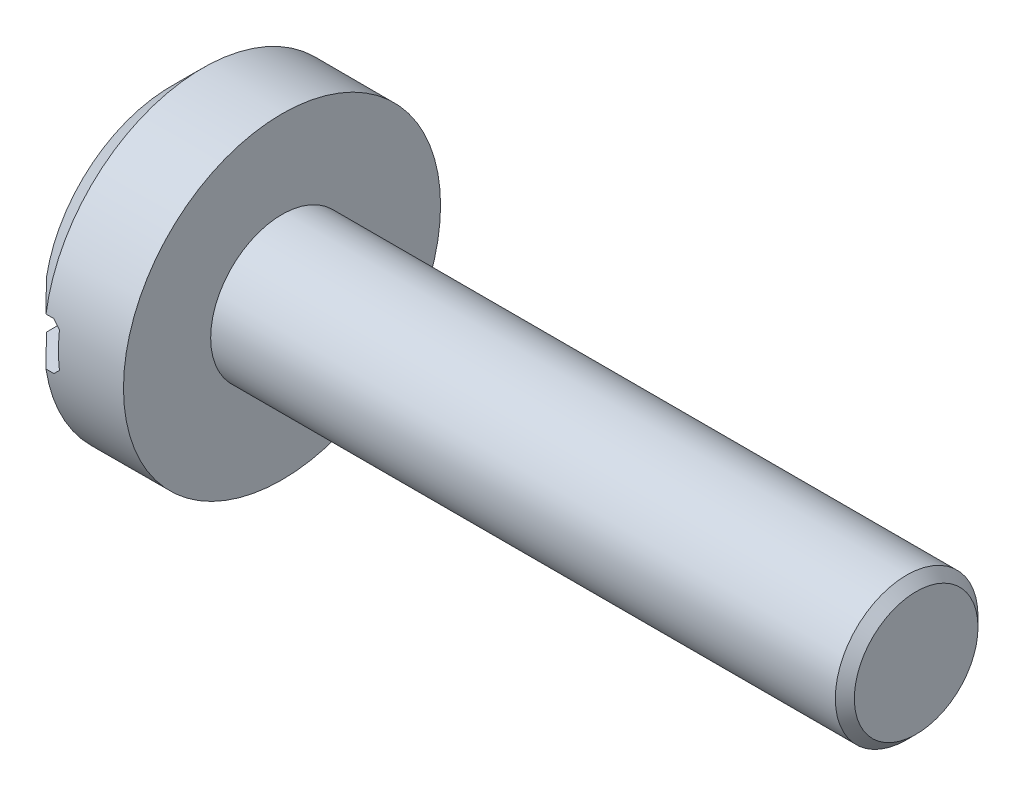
ISO-10303-21;
HEADER;
FILE_DESCRIPTION(('STEP AP214'),'2;1');
FILE_NAME('part.step','',(''),(''),'','','');
FILE_SCHEMA(('AUTOMOTIVE_DESIGN { 1 0 10303 214 1 1 1 1 }'));
ENDSEC;
DATA;
#1=APPLICATION_CONTEXT('core data for automotive mechanical design processes');
#2=APPLICATION_PROTOCOL_DEFINITION('international standard','automotive_design',2000,#1);
#3=PRODUCT_CONTEXT('',#1,'mechanical');
#4=PRODUCT('Part','Part','',(#3));
#5=PRODUCT_RELATED_PRODUCT_CATEGORY('part','',(#4));
#6=PRODUCT_DEFINITION_FORMATION('','',#4);
#7=PRODUCT_DEFINITION_CONTEXT('part definition',#1,'design');
#8=PRODUCT_DEFINITION('design','',#6,#7);
#9=PRODUCT_DEFINITION_SHAPE('','',#8);
#10=(LENGTH_UNIT() NAMED_UNIT(*) SI_UNIT(.MILLI.,.METRE.));
#11=(NAMED_UNIT(*) PLANE_ANGLE_UNIT() SI_UNIT($,.RADIAN.));
#12=(NAMED_UNIT(*) SI_UNIT($,.STERADIAN.) SOLID_ANGLE_UNIT());
#13=UNCERTAINTY_MEASURE_WITH_UNIT(LENGTH_MEASURE(1.E-05),#10,'distance_accuracy_value','');
#14=(GEOMETRIC_REPRESENTATION_CONTEXT(3) GLOBAL_UNCERTAINTY_ASSIGNED_CONTEXT((#13)) GLOBAL_UNIT_ASSIGNED_CONTEXT((#10,
#11,#12)) REPRESENTATION_CONTEXT('',''));
#15=CARTESIAN_POINT('',(0.,0.,0.));
#16=DIRECTION('',(0.,0.,1.));
#17=DIRECTION('',(1.,0.,0.));
#18=AXIS2_PLACEMENT_3D('',#15,#16,#17);
#19=CARTESIAN_POINT('',(3.5,5.,0.));
#20=DIRECTION('',(-1.,0.,0.));
#21=DIRECTION('',(0.,0.,1.));
#22=AXIS2_PLACEMENT_3D('',#19,#20,#21);
#23=PLANE('',#22);
#24=CARTESIAN_POINT('',(3.5,0.,0.));
#25=DIRECTION('',(-1.,0.,0.));
#26=DIRECTION('',(0.,0.,1.));
#27=AXIS2_PLACEMENT_3D('',#24,#25,#26);
#28=CIRCLE('',#27,5.);
#29=CARTESIAN_POINT('',(3.5,0.,5.));
#30=VERTEX_POINT('',#29);
#31=EDGE_CURVE('E99',#30,#30,#28,.T.);
#32=ORIENTED_EDGE('',*,*,#31,.F.);
#33=EDGE_LOOP('',(#32));
#34=FACE_BOUND('',#33,.T.);
#35=CARTESIAN_POINT('',(3.5,0.,0.));
#36=DIRECTION('',(-1.,0.,0.));
#37=DIRECTION('',(0.,0.,1.));
#38=AXIS2_PLACEMENT_3D('',#35,#36,#37);
#39=CIRCLE('',#38,2.25);
#40=CARTESIAN_POINT('',(3.5,0.,2.25));
#41=VERTEX_POINT('',#40);
#42=EDGE_CURVE('E136',#41,#41,#39,.F.);
#43=ORIENTED_EDGE('',*,*,#42,.F.);
#44=EDGE_LOOP('',(#43));
#45=FACE_BOUND('',#44,.T.);
#46=ADVANCED_FACE('F26',(#34,#45),#23,.F.);
#47=CARTESIAN_POINT('',(1.,0.,0.));
#48=DIRECTION('',(1.,0.,0.));
#49=DIRECTION('',(0.,0.,-1.));
#50=AXIS2_PLACEMENT_3D('',#47,#48,#49);
#51=CONICAL_SURFACE('',#50,5.,0.785398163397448);
#52=CARTESIAN_POINT('',(1.,0.,0.));
#53=DIRECTION('',(-1.,0.,0.));
#54=DIRECTION('',(0.,0.,1.));
#55=AXIS2_PLACEMENT_3D('',#52,#53,#54);
#56=CIRCLE('',#55,5.);
#57=CARTESIAN_POINT('',(1.,0.75,4.9434299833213));
#58=VERTEX_POINT('',#57);
#59=CARTESIAN_POINT('',(1.,0.75,-4.9434299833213));
#60=VERTEX_POINT('',#59);
#61=EDGE_CURVE('E121',#58,#60,#56,.T.);
#62=ORIENTED_EDGE('',*,*,#61,.T.);
#63=CARTESIAN_POINT('',(7.03012537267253,0.75,-11.0045974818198));
#64=CARTESIAN_POINT('',(6.65072201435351,0.75,-10.6243069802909));
#65=CARTESIAN_POINT('',(6.27135757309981,0.75,-10.2439776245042));
#66=CARTESIAN_POINT('',(5.51274800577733,0.75,-9.48318217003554));
#67=CARTESIAN_POINT('',(5.13350288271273,0.75,-9.10271606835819));
#68=CARTESIAN_POINT('',(4.37498838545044,0.75,-8.34140232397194));
#69=CARTESIAN_POINT('',(3.99571910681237,0.75,-7.96055458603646));
#70=CARTESIAN_POINT('',(3.23746281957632,0.75,-7.19859550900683));
#71=CARTESIAN_POINT('',(2.85847580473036,0.75,-6.81748417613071));
#72=CARTESIAN_POINT('',(2.09938544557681,0.75,-6.05326438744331));
#73=CARTESIAN_POINT('',(1.71928389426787,0.75,-5.67015414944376));
#74=CARTESIAN_POINT('',(1.14971850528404,0.75,-5.09488067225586));
#75=CARTESIAN_POINT('',(0.959954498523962,0.75,-4.90301469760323));
#76=CARTESIAN_POINT('',(0.58071485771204,0.75,-4.51900057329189));
#77=CARTESIAN_POINT('',(0.391239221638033,0.75,-4.32685242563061));
#78=CARTESIAN_POINT('',(0.0127694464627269,0.75,-3.94220808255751));
#79=CARTESIAN_POINT('',(-0.176224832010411,0.75,-3.74971202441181));
#80=CARTESIAN_POINT('',(-0.553564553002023,0.75,-3.36407475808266));
#81=CARTESIAN_POINT('',(-0.741909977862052,0.75,-3.17093353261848));
#82=CARTESIAN_POINT('',(-1.11750282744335,0.75,-2.78362867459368));
#83=CARTESIAN_POINT('',(-1.3047503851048,0.75,-2.58946517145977));
#84=CARTESIAN_POINT('',(-1.5840700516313,0.75,-2.29674613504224));
#85=CARTESIAN_POINT('',(-1.67691597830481,0.75,-2.19892965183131));
#86=CARTESIAN_POINT('',(-1.86184376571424,0.75,-2.00257777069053));
#87=CARTESIAN_POINT('',(-1.95392563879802,0.75,-1.90404238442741));
#88=CARTESIAN_POINT('',(-2.09519988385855,0.75,-1.7510526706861));
#89=CARTESIAN_POINT('',(-2.14480705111,0.75,-1.69698162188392));
#90=CARTESIAN_POINT('',(-2.24356406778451,0.75,-1.58841990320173));
#91=CARTESIAN_POINT('',(-2.29271390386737,0.75,-1.53392922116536));
#92=CARTESIAN_POINT('',(-2.39043946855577,0.75,-1.42435939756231));
#93=CARTESIAN_POINT('',(-2.43901472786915,0.75,-1.36927983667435));
#94=CARTESIAN_POINT('',(-2.53532026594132,0.75,-1.25838999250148));
#95=CARTESIAN_POINT('',(-2.58305059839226,0.75,-1.20257975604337));
#96=CARTESIAN_POINT('',(-2.66798512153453,0.75,-1.10107872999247));
#97=CARTESIAN_POINT('',(-2.70540474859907,0.75,-1.05556872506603));
#98=CARTESIAN_POINT('',(-2.77916585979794,0.75,-0.963684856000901));
#99=CARTESIAN_POINT('',(-2.81550743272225,0.75,-0.917311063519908));
#100=CARTESIAN_POINT('',(-2.88665253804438,0.75,-0.823398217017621));
#101=CARTESIAN_POINT('',(-2.92145624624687,0.75,-0.775859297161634));
#102=CARTESIAN_POINT('',(-2.98876467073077,0.75,-0.679192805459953));
#103=CARTESIAN_POINT('',(-3.02127049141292,0.75,-0.630066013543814));
#104=CARTESIAN_POINT('',(-3.08296458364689,0.75,-0.529211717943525));
#105=CARTESIAN_POINT('',(-3.11212542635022,0.75,-0.477467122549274));
#106=CARTESIAN_POINT('',(-3.16453270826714,0.75,-0.371006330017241));
#107=CARTESIAN_POINT('',(-3.18778740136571,0.75,-0.316294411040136));
#108=CARTESIAN_POINT('',(-3.22049853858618,0.75,-0.216346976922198));
#109=CARTESIAN_POINT('',(-3.23188688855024,0.75,-0.171770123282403));
#110=CARTESIAN_POINT('',(-3.2469012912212,0.75,-0.0813810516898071));
#111=CARTESIAN_POINT('',(-3.2505503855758,0.75,-0.0355729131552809));
#112=CARTESIAN_POINT('',(-3.24931001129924,0.75,0.0560387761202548));
#113=CARTESIAN_POINT('',(-3.24439828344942,0.75,0.101842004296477));
#114=CARTESIAN_POINT('',(-3.22708453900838,0.75,0.192036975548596));
#115=CARTESIAN_POINT('',(-3.21466383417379,0.75,0.236424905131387));
#116=CARTESIAN_POINT('',(-3.18235241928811,0.75,0.328895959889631));
#117=CARTESIAN_POINT('',(-3.161695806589,0.75,0.376700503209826));
#118=CARTESIAN_POINT('',(-3.11579054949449,0.75,0.470089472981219));
#119=CARTESIAN_POINT('',(-3.09053255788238,0.75,0.515669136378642));
#120=CARTESIAN_POINT('',(-3.03681278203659,0.75,0.605417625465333));
#121=CARTESIAN_POINT('',(-3.00832459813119,0.75,0.649570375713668));
#122=CARTESIAN_POINT('',(-2.94936099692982,0.75,0.736448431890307));
#123=CARTESIAN_POINT('',(-2.91888753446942,0.75,0.779175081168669));
#124=CARTESIAN_POINT('',(-2.85342343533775,0.75,0.867824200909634));
#125=CARTESIAN_POINT('',(-2.8182861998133,0.75,0.913637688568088));
#126=CARTESIAN_POINT('',(-2.74683416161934,0.75,1.00434011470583));
#127=CARTESIAN_POINT('',(-2.71051921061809,0.75,1.04922893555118));
#128=CARTESIAN_POINT('',(-2.60029175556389,0.75,1.18290062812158));
#129=CARTESIAN_POINT('',(-2.52512759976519,0.75,1.27064819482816));
#130=CARTESIAN_POINT('',(-2.37280922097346,0.75,1.44464108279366));
#131=CARTESIAN_POINT('',(-2.29565184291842,0.75,1.53088360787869));
#132=CARTESIAN_POINT('',(-2.14017796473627,0.75,1.70227416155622));
#133=CARTESIAN_POINT('',(-2.0618617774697,0.75,1.78742247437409));
#134=CARTESIAN_POINT('',(-1.90480962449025,0.75,1.95660472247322));
#135=CARTESIAN_POINT('',(-1.82607721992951,0.75,2.0406419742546));
#136=CARTESIAN_POINT('',(-1.66806546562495,0.75,2.20821082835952));
#137=CARTESIAN_POINT('',(-1.58878607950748,0.75,2.29174239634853));
#138=CARTESIAN_POINT('',(-1.42991409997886,0.75,2.45834685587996));
#139=CARTESIAN_POINT('',(-1.35032190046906,0.75,2.54142012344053));
#140=CARTESIAN_POINT('',(-1.19084446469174,0.75,2.70728111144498));
#141=CARTESIAN_POINT('',(-1.11095923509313,0.75,2.79006883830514));
#142=CARTESIAN_POINT('',(-0.86524852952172,0.75,3.04402003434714));
#143=CARTESIAN_POINT('',(-0.69905576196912,0.75,3.21482801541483));
#144=CARTESIAN_POINT('',(-0.366080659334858,0.75,3.55586861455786));
#145=CARTESIAN_POINT('',(-0.199298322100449,0.75,3.72610123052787));
#146=CARTESIAN_POINT('',(0.301629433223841,0.75,4.23624010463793));
#147=CARTESIAN_POINT('',(0.636349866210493,0.75,4.57558150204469));
#148=CARTESIAN_POINT('',(1.3067083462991,0.75,5.25368126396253));
#149=CARTESIAN_POINT('',(1.64234676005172,0.75,5.59243926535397));
#150=CARTESIAN_POINT('',(2.31406719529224,0.75,6.26950975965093));
#151=CARTESIAN_POINT('',(2.65014921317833,0.75,6.60782225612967));
#152=CARTESIAN_POINT('',(3.32307813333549,0.75,7.28466069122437));
#153=CARTESIAN_POINT('',(3.6599254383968,0.75,7.6231862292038));
#154=CARTESIAN_POINT('',(4.33380810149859,0.75,8.3000519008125));
#155=CARTESIAN_POINT('',(4.67084346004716,0.75,8.63839203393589));
#156=CARTESIAN_POINT('',(5.34486656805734,0.75,9.31476389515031));
#157=CARTESIAN_POINT('',(5.68185424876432,0.75,9.65279569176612));
#158=CARTESIAN_POINT('',(6.35592573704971,0.75,10.3287614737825));
#159=CARTESIAN_POINT('',(6.69300954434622,0.75,10.6666954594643));
#160=CARTESIAN_POINT('',(7.03012537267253,0.75,11.0045974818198));
#161=B_SPLINE_CURVE_WITH_KNOTS('',3,(#63,#64,#65,#66,#67,#68,#69,#70,#71,#72,#73,#74,#75,#76,
#77,#78,#79,#80,#81,#82,#83,#84,#85,#86,#87,#88,#89,#90,#91,#92,#93,#94,#95,#96,#97,#98,#99,
#100,#101,#102,#103,#104,#105,#106,#107,#108,#109,#110,#111,#112,#113,#114,#115,#116,#117,#118,
#119,#120,#121,#122,#123,#124,#125,#126,#127,#128,#129,#130,#131,#132,#133,#134,#135,#136,#137,
#138,#139,#140,#141,#142,#143,#144,#145,#146,#147,#148,#149,#150,#151,#152,#153,#154,#155,#156,
#157,#158,#159,#160),.UNSPECIFIED.,.F.,.F.,(4,2,2,2,2,2,2,2,2,2,2,2,2,2,2,2,2,2,2,2,2,2,2,2,2,2,
2,2,2,2,2,2,2,2,2,2,2,2,2,2,2,2,2,2,2,2,2,2,4),(0.,1.61155516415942,3.22314809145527,
4.83560315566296,6.44802139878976,8.0670498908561,8.87662139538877,9.68618719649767,
10.49548331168,11.3048012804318,12.1140191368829,12.5186103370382,12.9231949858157,
13.1433315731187,13.3634745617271,13.583786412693,13.8040842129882,13.9808284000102,
14.1575579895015,14.3342673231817,14.5108911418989,14.6888729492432,14.8666046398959,
15.0041007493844,15.1411869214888,15.2786300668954,15.4164166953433,15.5722691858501,
15.7284418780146,15.8859980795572,16.0434014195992,16.2165832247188,16.389786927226,
16.7363472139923,17.0834944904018,17.4305496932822,17.7760166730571,18.1215068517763,
18.4666505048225,18.8117863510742,19.5267371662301,20.2416905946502,21.6716220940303,
23.1022479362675,24.5328622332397,25.9655487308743,27.3982391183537,28.830173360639,
30.262103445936),.UNSPECIFIED.);
#162=CARTESIAN_POINT('',(0.,0.75,-3.92905841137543));
#163=VERTEX_POINT('',#162);
#164=EDGE_CURVE('E116',#60,#163,#161,.T.);
#165=ORIENTED_EDGE('',*,*,#164,.T.);
#166=CARTESIAN_POINT('',(0.,0.,0.));
#167=DIRECTION('',(-1.,0.,0.));
#168=DIRECTION('',(0.,0.,1.));
#169=AXIS2_PLACEMENT_3D('',#166,#167,#168);
#170=CIRCLE('',#169,4.);
#171=CARTESIAN_POINT('',(0.,0.75,3.92905841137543));
#172=VERTEX_POINT('',#171);
#173=EDGE_CURVE('E111',#172,#163,#170,.T.);
#174=ORIENTED_EDGE('',*,*,#173,.F.);
#175=EDGE_CURVE('E183',#172,#58,#161,.T.);
#176=ORIENTED_EDGE('',*,*,#175,.T.);
#177=EDGE_LOOP('',(#62,#165,#174,#176));
#178=FACE_BOUND('',#177,.T.);
#179=ADVANCED_FACE('F154',(#178),#51,.T.);
#180=CARTESIAN_POINT('',(0.,0.,0.));
#181=DIRECTION('',(1.,0.,0.));
#182=DIRECTION('',(0.,0.,-1.));
#183=AXIS2_PLACEMENT_3D('',#180,#181,#182);
#184=PLANE('',#183);
#185=ORIENTED_EDGE('',*,*,#173,.T.);
#186=DIRECTION('',(0.,0.,1.));
#187=VECTOR('',#186,1.);
#188=CARTESIAN_POINT('',(0.,0.75,0.));
#189=LINE('',#188,#187);
#190=EDGE_CURVE('E98',#163,#172,#189,.T.);
#191=ORIENTED_EDGE('',*,*,#190,.T.);
#192=EDGE_LOOP('',(#185,#191));
#193=FACE_BOUND('',#192,.T.);
#194=ADVANCED_FACE('F161',(#193),#184,.F.);
#195=CARTESIAN_POINT('',(0.,0.,0.));
#196=DIRECTION('',(-1.,0.,0.));
#197=DIRECTION('',(0.,0.,1.));
#198=AXIS2_PLACEMENT_3D('',#195,#196,#197);
#199=CYLINDRICAL_SURFACE('',#198,5.);
#200=ORIENTED_EDGE('',*,*,#61,.F.);
#201=DIRECTION('',(-1.,0.,0.));
#202=VECTOR('',#201,1.);
#203=CARTESIAN_POINT('',(0.,0.75,4.9434299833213));
#204=LINE('',#203,#202);
#205=CARTESIAN_POINT('',(1.25,0.75,4.9434299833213));
#206=VERTEX_POINT('',#205);
#207=EDGE_CURVE('E189',#58,#206,#204,.F.);
#208=ORIENTED_EDGE('',*,*,#207,.T.);
#209=CARTESIAN_POINT('',(2.,0.,0.));
#210=DIRECTION('',(0.707106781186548,0.707106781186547,0.));
#211=DIRECTION('',(-0.707106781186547,0.707106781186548,0.));
#212=AXIS2_PLACEMENT_3D('',#209,#210,#211);
#213=ELLIPSE('',#212,7.07106781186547,5.);
#214=CARTESIAN_POINT('',(1.45,0.55,4.9696579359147));
#215=VERTEX_POINT('',#214);
#216=EDGE_CURVE('E135',#206,#215,#213,.T.);
#217=ORIENTED_EDGE('',*,*,#216,.T.);
#218=CARTESIAN_POINT('',(1.45,0.,0.));
#219=DIRECTION('',(1.,0.,0.));
#220=DIRECTION('',(0.,1.,0.));
#221=AXIS2_PLACEMENT_3D('',#218,#219,#220);
#222=CIRCLE('',#221,5.);
#223=CARTESIAN_POINT('',(1.45,-0.55,4.9696579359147));
#224=VERTEX_POINT('',#223);
#225=EDGE_CURVE('E48',#215,#224,#222,.T.);
#226=ORIENTED_EDGE('',*,*,#225,.T.);
#227=CARTESIAN_POINT('',(2.,0.,0.));
#228=DIRECTION('',(0.707106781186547,-0.707106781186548,0.));
#229=DIRECTION('',(-0.707106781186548,-0.707106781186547,0.));
#230=AXIS2_PLACEMENT_3D('',#227,#228,#229);
#231=ELLIPSE('',#230,7.07106781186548,5.);
#232=CARTESIAN_POINT('',(1.25,-0.75,4.9434299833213));
#233=VERTEX_POINT('',#232);
#234=EDGE_CURVE('E127',#224,#233,#231,.T.);
#235=ORIENTED_EDGE('',*,*,#234,.T.);
#236=DIRECTION('',(-1.,0.,0.));
#237=VECTOR('',#236,1.);
#238=CARTESIAN_POINT('',(0.,-0.75,4.9434299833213));
#239=LINE('',#238,#237);
#240=CARTESIAN_POINT('',(1.,-0.75,4.9434299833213));
#241=VERTEX_POINT('',#240);
#242=EDGE_CURVE('E107',#233,#241,#239,.T.);
#243=ORIENTED_EDGE('',*,*,#242,.T.);
#244=CARTESIAN_POINT('',(1.,-0.75,-4.9434299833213));
#245=VERTEX_POINT('',#244);
#246=EDGE_CURVE('E106',#245,#241,#56,.T.);
#247=ORIENTED_EDGE('',*,*,#246,.F.);
#248=DIRECTION('',(-1.,0.,0.));
#249=VECTOR('',#248,1.);
#250=CARTESIAN_POINT('',(0.,-0.75,-4.9434299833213));
#251=LINE('',#250,#249);
#252=CARTESIAN_POINT('',(1.25,-0.75,-4.9434299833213));
#253=VERTEX_POINT('',#252);
#254=EDGE_CURVE('E108',#245,#253,#251,.F.);
#255=ORIENTED_EDGE('',*,*,#254,.T.);
#256=CARTESIAN_POINT('',(1.45,-0.55,-4.9696579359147));
#257=VERTEX_POINT('',#256);
#258=EDGE_CURVE('E131',#253,#257,#231,.T.);
#259=ORIENTED_EDGE('',*,*,#258,.T.);
#260=CARTESIAN_POINT('',(1.45,0.55,-4.9696579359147));
#261=VERTEX_POINT('',#260);
#262=EDGE_CURVE('E128',#257,#261,#222,.T.);
#263=ORIENTED_EDGE('',*,*,#262,.T.);
#264=CARTESIAN_POINT('',(1.25,0.75,-4.9434299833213));
#265=VERTEX_POINT('',#264);
#266=EDGE_CURVE('E132',#261,#265,#213,.T.);
#267=ORIENTED_EDGE('',*,*,#266,.T.);
#268=DIRECTION('',(-1.,0.,0.));
#269=VECTOR('',#268,1.);
#270=CARTESIAN_POINT('',(0.,0.75,-4.9434299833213));
#271=LINE('',#270,#269);
#272=EDGE_CURVE('E112',#265,#60,#271,.T.);
#273=ORIENTED_EDGE('',*,*,#272,.T.);
#274=EDGE_LOOP('',(#200,#208,#217,#226,#235,#243,#247,#255,#259,#263,#267,#273));
#275=FACE_BOUND('',#274,.T.);
#276=ORIENTED_EDGE('',*,*,#31,.T.);
#277=EDGE_LOOP('',(#276));
#278=FACE_BOUND('',#277,.T.);
#279=ADVANCED_FACE('F194',(#275,#278),#199,.T.);
#280=ORIENTED_EDGE('',*,*,#246,.T.);
#281=CARTESIAN_POINT('',(7.03012537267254,-0.75,11.0045974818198));
#282=CARTESIAN_POINT('',(6.65072201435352,-0.75,10.6243069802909));
#283=CARTESIAN_POINT('',(6.27135757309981,-0.75,10.2439776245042));
#284=CARTESIAN_POINT('',(5.51274800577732,-0.75,9.48318217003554));
#285=CARTESIAN_POINT('',(5.13350288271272,-0.75,9.10271606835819));
#286=CARTESIAN_POINT('',(4.37498838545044,-0.75,8.34140232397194));
#287=CARTESIAN_POINT('',(3.99571910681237,-0.75,7.96055458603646));
#288=CARTESIAN_POINT('',(3.23746281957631,-0.75,7.19859550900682));
#289=CARTESIAN_POINT('',(2.85847580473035,-0.75,6.8174841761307));
#290=CARTESIAN_POINT('',(2.0993854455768,-0.75,6.0532643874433));
#291=CARTESIAN_POINT('',(1.71928389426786,-0.75,5.67015414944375));
#292=CARTESIAN_POINT('',(1.14971850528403,-0.75,5.09488067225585));
#293=CARTESIAN_POINT('',(0.959954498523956,-0.75,4.90301469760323));
#294=CARTESIAN_POINT('',(0.580714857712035,-0.75,4.51900057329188));
#295=CARTESIAN_POINT('',(0.391239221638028,-0.75,4.3268524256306));
#296=CARTESIAN_POINT('',(0.0127694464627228,-0.75,3.94220808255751));
#297=CARTESIAN_POINT('',(-0.176224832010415,-0.75,3.7497120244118));
#298=CARTESIAN_POINT('',(-0.553564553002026,-0.75,3.36407475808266));
#299=CARTESIAN_POINT('',(-0.741909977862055,-0.75,3.17093353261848));
#300=CARTESIAN_POINT('',(-1.11750282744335,-0.75,2.78362867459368));
#301=CARTESIAN_POINT('',(-1.3047503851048,-0.75,2.58946517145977));
#302=CARTESIAN_POINT('',(-1.5840700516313,-0.75,2.29674613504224));
#303=CARTESIAN_POINT('',(-1.67691597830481,-0.75,2.19892965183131));
#304=CARTESIAN_POINT('',(-1.86184376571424,-0.75,2.00257777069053));
#305=CARTESIAN_POINT('',(-1.95392563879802,-0.75,1.90404238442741));
#306=CARTESIAN_POINT('',(-2.09519988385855,-0.75,1.75105267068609));
#307=CARTESIAN_POINT('',(-2.14480705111,-0.75,1.69698162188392));
#308=CARTESIAN_POINT('',(-2.24356406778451,-0.75,1.58841990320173));
#309=CARTESIAN_POINT('',(-2.29271390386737,-0.75,1.53392922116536));
#310=CARTESIAN_POINT('',(-2.39043946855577,-0.75,1.42435939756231));
#311=CARTESIAN_POINT('',(-2.43901472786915,-0.75,1.36927983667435));
#312=CARTESIAN_POINT('',(-2.53532026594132,-0.75,1.25838999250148));
#313=CARTESIAN_POINT('',(-2.58305059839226,-0.75,1.20257975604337));
#314=CARTESIAN_POINT('',(-2.66798512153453,-0.75,1.10107872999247));
#315=CARTESIAN_POINT('',(-2.70540474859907,-0.75,1.05556872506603));
#316=CARTESIAN_POINT('',(-2.77916585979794,-0.75,0.963684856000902));
#317=CARTESIAN_POINT('',(-2.81550743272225,-0.75,0.917311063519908));
#318=CARTESIAN_POINT('',(-2.88665253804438,-0.75,0.823398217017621));
#319=CARTESIAN_POINT('',(-2.92145624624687,-0.75,0.775859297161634));
#320=CARTESIAN_POINT('',(-2.98876467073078,-0.75,0.679192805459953));
#321=CARTESIAN_POINT('',(-3.02127049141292,-0.75,0.630066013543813));
#322=CARTESIAN_POINT('',(-3.08296458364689,-0.75,0.529211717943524));
#323=CARTESIAN_POINT('',(-3.11212542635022,-0.75,0.477467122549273));
#324=CARTESIAN_POINT('',(-3.16453270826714,-0.75,0.371006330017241));
#325=CARTESIAN_POINT('',(-3.18778740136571,-0.75,0.316294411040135));
#326=CARTESIAN_POINT('',(-3.22049853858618,-0.75,0.216346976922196));
#327=CARTESIAN_POINT('',(-3.23188688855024,-0.75,0.171770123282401));
#328=CARTESIAN_POINT('',(-3.2469012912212,-0.75,0.0813810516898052));
#329=CARTESIAN_POINT('',(-3.2505503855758,-0.75,0.0355729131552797));
#330=CARTESIAN_POINT('',(-3.24931001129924,-0.75,-0.0560387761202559));
#331=CARTESIAN_POINT('',(-3.24439828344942,-0.75,-0.101842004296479));
#332=CARTESIAN_POINT('',(-3.22708453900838,-0.75,-0.192036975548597));
#333=CARTESIAN_POINT('',(-3.21466383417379,-0.75,-0.236424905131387));
#334=CARTESIAN_POINT('',(-3.18235241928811,-0.75,-0.328895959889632));
#335=CARTESIAN_POINT('',(-3.161695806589,-0.75,-0.376700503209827));
#336=CARTESIAN_POINT('',(-3.11579054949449,-0.75,-0.470089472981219));
#337=CARTESIAN_POINT('',(-3.09053255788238,-0.75,-0.515669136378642));
#338=CARTESIAN_POINT('',(-3.03681278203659,-0.75,-0.605417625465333));
#339=CARTESIAN_POINT('',(-3.00832459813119,-0.75,-0.649570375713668));
#340=CARTESIAN_POINT('',(-2.94936099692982,-0.75,-0.736448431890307));
#341=CARTESIAN_POINT('',(-2.91888753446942,-0.75,-0.779175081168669));
#342=CARTESIAN_POINT('',(-2.85342343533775,-0.75,-0.867824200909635));
#343=CARTESIAN_POINT('',(-2.8182861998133,-0.75,-0.913637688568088));
#344=CARTESIAN_POINT('',(-2.74683416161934,-0.75,-1.00434011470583));
#345=CARTESIAN_POINT('',(-2.71051921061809,-0.75,-1.04922893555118));
#346=CARTESIAN_POINT('',(-2.60029175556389,-0.75,-1.18290062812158));
#347=CARTESIAN_POINT('',(-2.52512759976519,-0.75,-1.27064819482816));
#348=CARTESIAN_POINT('',(-2.37280922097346,-0.75,-1.44464108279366));
#349=CARTESIAN_POINT('',(-2.29565184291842,-0.75,-1.53088360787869));
#350=CARTESIAN_POINT('',(-2.14017796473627,-0.75,-1.70227416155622));
#351=CARTESIAN_POINT('',(-2.0618617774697,-0.75,-1.78742247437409));
#352=CARTESIAN_POINT('',(-1.90480962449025,-0.75,-1.95660472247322));
#353=CARTESIAN_POINT('',(-1.82607721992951,-0.75,-2.0406419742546));
#354=CARTESIAN_POINT('',(-1.66806546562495,-0.75,-2.20821082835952));
#355=CARTESIAN_POINT('',(-1.58878607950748,-0.75,-2.29174239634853));
#356=CARTESIAN_POINT('',(-1.42991409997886,-0.75,-2.45834685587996));
#357=CARTESIAN_POINT('',(-1.35032190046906,-0.75,-2.54142012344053));
#358=CARTESIAN_POINT('',(-1.19084446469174,-0.75,-2.70728111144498));
#359=CARTESIAN_POINT('',(-1.11095923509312,-0.75,-2.79006883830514));
#360=CARTESIAN_POINT('',(-0.865248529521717,-0.75,-3.04402003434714));
#361=CARTESIAN_POINT('',(-0.699055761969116,-0.75,-3.21482801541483));
#362=CARTESIAN_POINT('',(-0.366080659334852,-0.75,-3.55586861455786));
#363=CARTESIAN_POINT('',(-0.199298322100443,-0.75,-3.72610123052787));
#364=CARTESIAN_POINT('',(0.301629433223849,-0.75,-4.23624010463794));
#365=CARTESIAN_POINT('',(0.6363498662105,-0.75,-4.5755815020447));
#366=CARTESIAN_POINT('',(1.30670834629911,-0.75,-5.25368126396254));
#367=CARTESIAN_POINT('',(1.64234676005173,-0.75,-5.59243926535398));
#368=CARTESIAN_POINT('',(2.31406719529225,-0.75,-6.26950975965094));
#369=CARTESIAN_POINT('',(2.65014921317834,-0.75,-6.60782225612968));
#370=CARTESIAN_POINT('',(3.3230781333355,-0.75,-7.28466069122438));
#371=CARTESIAN_POINT('',(3.65992543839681,-0.75,-7.62318622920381));
#372=CARTESIAN_POINT('',(4.3338081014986,-0.75,-8.30005190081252));
#373=CARTESIAN_POINT('',(4.67084346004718,-0.75,-8.6383920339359));
#374=CARTESIAN_POINT('',(5.34486656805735,-0.75,-9.31476389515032));
#375=CARTESIAN_POINT('',(5.68185424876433,-0.75,-9.65279569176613));
#376=CARTESIAN_POINT('',(6.35592573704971,-0.75,-10.3287614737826));
#377=CARTESIAN_POINT('',(6.69300954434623,-0.75,-10.6666954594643));
#378=CARTESIAN_POINT('',(7.03012537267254,-0.75,-11.0045974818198));
#379=B_SPLINE_CURVE_WITH_KNOTS('',3,(#281,#282,#283,#284,#285,#286,#287,#288,#289,#290,#291,
#292,#293,#294,#295,#296,#297,#298,#299,#300,#301,#302,#303,#304,#305,#306,#307,#308,#309,#310,
#311,#312,#313,#314,#315,#316,#317,#318,#319,#320,#321,#322,#323,#324,#325,#326,#327,#328,#329,
#330,#331,#332,#333,#334,#335,#336,#337,#338,#339,#340,#341,#342,#343,#344,#345,#346,#347,#348,
#349,#350,#351,#352,#353,#354,#355,#356,#357,#358,#359,#360,#361,#362,#363,#364,#365,#366,#367,
#368,#369,#370,#371,#372,#373,#374,#375,#376,#377,#378),.UNSPECIFIED.,.F.,.F.,(4,2,2,2,2,2,2,2,
2,2,2,2,2,2,2,2,2,2,2,2,2,2,2,2,2,2,2,2,2,2,2,2,2,2,2,2,2,2,2,2,2,2,2,2,2,2,2,2,4),(0.,
1.61155516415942,3.22314809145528,4.83560315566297,6.44802139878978,8.06704989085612,
8.87662139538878,9.68618719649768,10.49548331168,11.3048012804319,12.1140191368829,
12.5186103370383,12.9231949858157,13.1433315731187,13.3634745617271,13.583786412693,
13.8040842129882,13.9808284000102,14.1575579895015,14.3342673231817,14.5108911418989,
14.6888729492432,14.8666046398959,15.0041007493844,15.1411869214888,15.2786300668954,
15.4164166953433,15.5722691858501,15.7284418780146,15.8859980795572,16.0434014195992,
16.2165832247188,16.3897869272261,16.7363472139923,17.0834944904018,17.4305496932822,
17.7760166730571,18.1215068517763,18.4666505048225,18.8117863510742,19.5267371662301,
20.2416905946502,21.6716220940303,23.1022479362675,24.5328622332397,25.9655487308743,
27.3982391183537,28.830173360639,30.262103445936),.UNSPECIFIED.);
#380=CARTESIAN_POINT('',(0.,-0.75,3.92905841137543));
#381=VERTEX_POINT('',#380);
#382=EDGE_CURVE('E93',#241,#381,#379,.T.);
#383=ORIENTED_EDGE('',*,*,#382,.T.);
#384=CARTESIAN_POINT('',(0.,-0.75,-3.92905841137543));
#385=VERTEX_POINT('',#384);
#386=EDGE_CURVE('E104',#385,#381,#170,.T.);
#387=ORIENTED_EDGE('',*,*,#386,.F.);
#388=EDGE_CURVE('E40',#385,#245,#379,.T.);
#389=ORIENTED_EDGE('',*,*,#388,.T.);
#390=EDGE_LOOP('',(#280,#383,#387,#389));
#391=FACE_BOUND('',#390,.T.);
#392=ADVANCED_FACE('F103',(#391),#51,.T.);
#393=ORIENTED_EDGE('',*,*,#386,.T.);
#394=DIRECTION('',(0.,0.,-1.));
#395=VECTOR('',#394,1.);
#396=CARTESIAN_POINT('',(0.,-0.75,0.));
#397=LINE('',#396,#395);
#398=EDGE_CURVE('E89',#381,#385,#397,.T.);
#399=ORIENTED_EDGE('',*,*,#398,.T.);
#400=EDGE_LOOP('',(#393,#399));
#401=FACE_BOUND('',#400,.T.);
#402=ADVANCED_FACE('F110',(#401),#184,.F.);
#403=CARTESIAN_POINT('',(1.25,0.75,-5.));
#404=DIRECTION('',(0.707106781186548,0.707106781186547,0.));
#405=DIRECTION('',(-0.707106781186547,0.707106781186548,0.));
#406=AXIS2_PLACEMENT_3D('',#403,#404,#405);
#407=PLANE('',#406);
#408=DIRECTION('',(0.,0.,1.));
#409=VECTOR('',#408,1.);
#410=CARTESIAN_POINT('',(1.25,0.75,-5.));
#411=LINE('',#410,#409);
#412=EDGE_CURVE('E200',#265,#206,#411,.T.);
#413=ORIENTED_EDGE('',*,*,#412,.F.);
#414=ORIENTED_EDGE('',*,*,#266,.F.);
#415=DIRECTION('',(0.,0.,1.));
#416=VECTOR('',#415,1.);
#417=CARTESIAN_POINT('',(1.45,0.55,-5.));
#418=LINE('',#417,#416);
#419=EDGE_CURVE('E213',#261,#215,#418,.T.);
#420=ORIENTED_EDGE('',*,*,#419,.T.);
#421=ORIENTED_EDGE('',*,*,#216,.F.);
#422=EDGE_LOOP('',(#413,#414,#420,#421));
#423=FACE_BOUND('',#422,.T.);
#424=ADVANCED_FACE('F180',(#423),#407,.F.);
#425=CARTESIAN_POINT('',(1.45,0.55,-5.));
#426=DIRECTION('',(1.,0.,0.));
#427=DIRECTION('',(0.,1.,0.));
#428=AXIS2_PLACEMENT_3D('',#425,#426,#427);
#429=PLANE('',#428);
#430=ORIENTED_EDGE('',*,*,#419,.F.);
#431=ORIENTED_EDGE('',*,*,#262,.F.);
#432=DIRECTION('',(0.,0.,1.));
#433=VECTOR('',#432,1.);
#434=CARTESIAN_POINT('',(1.45,-0.55,-5.));
#435=LINE('',#434,#433);
#436=EDGE_CURVE('E217',#257,#224,#435,.T.);
#437=ORIENTED_EDGE('',*,*,#436,.T.);
#438=ORIENTED_EDGE('',*,*,#225,.F.);
#439=EDGE_LOOP('',(#430,#431,#437,#438));
#440=FACE_BOUND('',#439,.T.);
#441=ADVANCED_FACE('F206',(#440),#429,.F.);
#442=CARTESIAN_POINT('',(1.25,-0.75,-5.));
#443=DIRECTION('',(0.707106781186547,-0.707106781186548,0.));
#444=DIRECTION('',(0.707106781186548,0.707106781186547,0.));
#445=AXIS2_PLACEMENT_3D('',#442,#443,#444);
#446=PLANE('',#445);
#447=DIRECTION('',(0.,0.,1.));
#448=VECTOR('',#447,1.);
#449=CARTESIAN_POINT('',(1.25,-0.75,-5.));
#450=LINE('',#449,#448);
#451=EDGE_CURVE('E201',#253,#233,#450,.T.);
#452=ORIENTED_EDGE('',*,*,#451,.T.);
#453=ORIENTED_EDGE('',*,*,#234,.F.);
#454=ORIENTED_EDGE('',*,*,#436,.F.);
#455=ORIENTED_EDGE('',*,*,#258,.F.);
#456=EDGE_LOOP('',(#452,#453,#454,#455));
#457=FACE_BOUND('',#456,.T.);
#458=ADVANCED_FACE('F178',(#457),#446,.F.);
#459=CARTESIAN_POINT('',(0.,0.75,-5.));
#460=DIRECTION('',(0.,1.,0.));
#461=DIRECTION('',(0.,0.,1.));
#462=AXIS2_PLACEMENT_3D('',#459,#460,#461);
#463=PLANE('',#462);
#464=ORIENTED_EDGE('',*,*,#412,.T.);
#465=ORIENTED_EDGE('',*,*,#207,.F.);
#466=ORIENTED_EDGE('',*,*,#175,.F.);
#467=ORIENTED_EDGE('',*,*,#190,.F.);
#468=ORIENTED_EDGE('',*,*,#164,.F.);
#469=ORIENTED_EDGE('',*,*,#272,.F.);
#470=EDGE_LOOP('',(#464,#465,#466,#467,#468,#469));
#471=FACE_BOUND('',#470,.T.);
#472=ADVANCED_FACE('F172',(#471),#463,.F.);
#473=CARTESIAN_POINT('',(0.,-0.75,-5.));
#474=DIRECTION('',(0.,-1.,0.));
#475=DIRECTION('',(0.,0.,-1.));
#476=AXIS2_PLACEMENT_3D('',#473,#474,#475);
#477=PLANE('',#476);
#478=ORIENTED_EDGE('',*,*,#451,.F.);
#479=ORIENTED_EDGE('',*,*,#254,.F.);
#480=ORIENTED_EDGE('',*,*,#388,.F.);
#481=ORIENTED_EDGE('',*,*,#398,.F.);
#482=ORIENTED_EDGE('',*,*,#382,.F.);
#483=ORIENTED_EDGE('',*,*,#242,.F.);
#484=EDGE_LOOP('',(#478,#479,#480,#481,#482,#483));
#485=FACE_BOUND('',#484,.T.);
#486=ADVANCED_FACE('F92',(#485),#477,.F.);
#487=CARTESIAN_POINT('',(23.5,0.,0.));
#488=DIRECTION('',(-1.,0.,0.));
#489=DIRECTION('',(0.,0.,1.));
#490=AXIS2_PLACEMENT_3D('',#487,#488,#489);
#491=CYLINDRICAL_SURFACE('',#490,2.25);
#492=CARTESIAN_POINT('',(23.2,0.,0.));
#493=DIRECTION('',(1.,0.,0.));
#494=DIRECTION('',(0.,0.,-1.));
#495=AXIS2_PLACEMENT_3D('',#492,#493,#494);
#496=CIRCLE('',#495,2.25);
#497=CARTESIAN_POINT('',(23.2,0.,-2.25));
#498=VERTEX_POINT('',#497);
#499=EDGE_CURVE('E11',#498,#498,#496,.F.);
#500=ORIENTED_EDGE('',*,*,#499,.T.);
#501=EDGE_LOOP('',(#500));
#502=FACE_BOUND('',#501,.T.);
#503=ORIENTED_EDGE('',*,*,#42,.T.);
#504=EDGE_LOOP('',(#503));
#505=FACE_BOUND('',#504,.T.);
#506=ADVANCED_FACE('F150',(#502,#505),#491,.T.);
#507=CARTESIAN_POINT('',(23.5,0.,0.));
#508=DIRECTION('',(1.,0.,0.));
#509=DIRECTION('',(0.,0.,-1.));
#510=AXIS2_PLACEMENT_3D('',#507,#508,#509);
#511=PLANE('',#510);
#512=CARTESIAN_POINT('',(23.5,0.,0.));
#513=DIRECTION('',(1.,0.,0.));
#514=DIRECTION('',(0.,0.,-1.));
#515=AXIS2_PLACEMENT_3D('',#512,#513,#514);
#516=CIRCLE('',#515,1.95);
#517=CARTESIAN_POINT('',(23.5,0.,-1.95));
#518=VERTEX_POINT('',#517);
#519=EDGE_CURVE('E33',#518,#518,#516,.T.);
#520=ORIENTED_EDGE('',*,*,#519,.T.);
#521=EDGE_LOOP('',(#520));
#522=FACE_BOUND('',#521,.T.);
#523=ADVANCED_FACE('F141',(#522),#511,.T.);
#524=CARTESIAN_POINT('',(23.5,0.,0.));
#525=DIRECTION('',(-1.,0.,0.));
#526=DIRECTION('',(0.,0.,1.));
#527=AXIS2_PLACEMENT_3D('',#524,#525,#526);
#528=CONICAL_SURFACE('',#527,1.95,0.78539816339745);
#529=ORIENTED_EDGE('',*,*,#499,.F.);
#530=EDGE_LOOP('',(#529));
#531=FACE_BOUND('',#530,.T.);
#532=ORIENTED_EDGE('',*,*,#519,.F.);
#533=EDGE_LOOP('',(#532));
#534=FACE_BOUND('',#533,.T.);
#535=ADVANCED_FACE('F143',(#531,#534),#528,.T.);
#536=CLOSED_SHELL('',(#46,#179,#194,#279,#392,#402,#424,#441,#458,#472,#486,#506,#523,#535));
#537=MANIFOLD_SOLID_BREP('B2',#536);
#538=ADVANCED_BREP_SHAPE_REPRESENTATION('',(#18,#537),#14);
#539=SHAPE_DEFINITION_REPRESENTATION(#9,#538);
ENDSEC;
END-ISO-10303-21;
